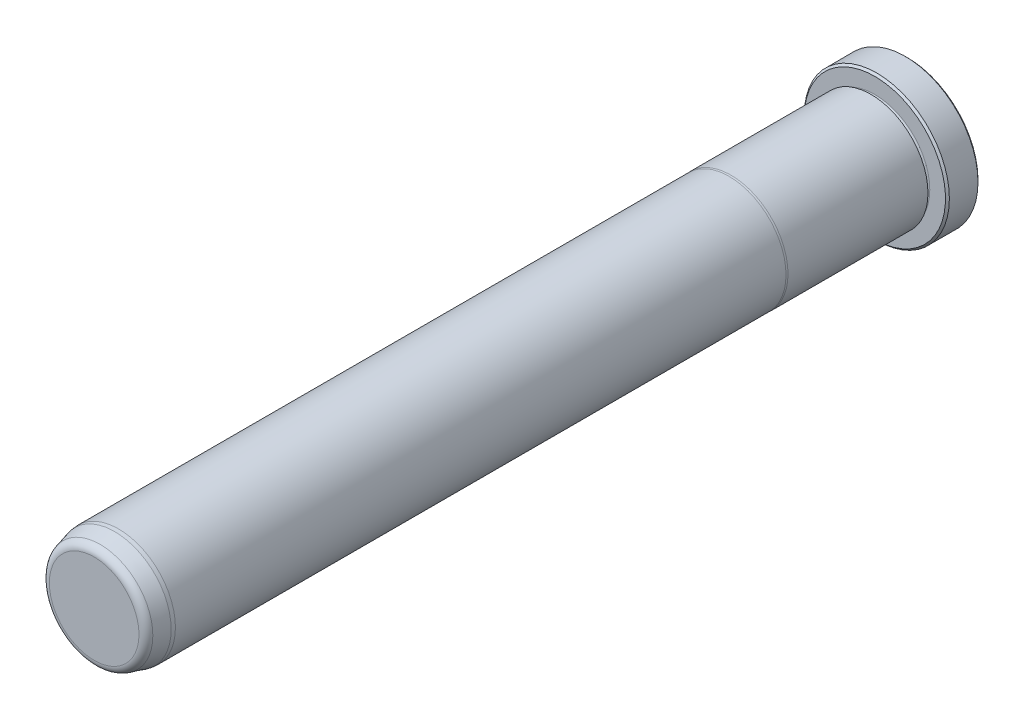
from build123d import *

# Parameters (mm, degrees)
FILLET6_R     = 1.5875
CHAMFER1_SIZE = 0.381


with BuildPart() as part:
    # Sketch1 → Revolve1 (revolve)
    with BuildSketch(Plane(origin=(0, 0, 0), x_dir=(0, 0, -1), z_dir=(1, 0, 0)), mode=Mode.PRIVATE) as revolve1_sk:
        with BuildLine():
            Line((0, 0), (0, 14.1605))
            Line((0, 14.1605), (-6.35, 14.1605))
            Line((-6.35, 14.1605), (-6.35, 10.7188))
            ThreePointArc((-6.35, 10.7188), (-6.731, 10.3378), (-7.112, 10.7188))
            Line((-7.112, 10.7188), (-7.112, 11.1252))
            Line((-7.112, 11.1252), (-34.434763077, 11.1252))
            Line((-34.434763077, 11.1252), (-34.798, 11.0998))
            Line((-34.798, 11.0998), (-153.9875, 11.0998))
            Line((-153.9875, 11.0998), (-154.7495, 11.033133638))
            Line((-154.7495, 11.033133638), (-158.75, 9.961202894))
            Line((-158.75, 9.961202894), (-158.75, 0))
            Line((-158.75, 0), (0, 0))
        make_face()
    revolve(revolve1_sk.sketch.rotate(Axis((0, 0, 0), (0, 0, -1)), 90), axis=Axis((0, 0, 0), (0, 0, -1)))

    # Fillet6
    fillet6_edges = [part.edges().sort_by_distance(p)[0] for p in [
        (-9.961202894, 0, 158.75),
    ]]
    fillet(fillet6_edges, radius=FILLET6_R)

    # Chamfer1
    chamfer1_edges = [part.edges().sort_by_distance(p)[0] for p in [
        (-14.1605, 0, 6.35),
        (-14.1605, 0, 0),
    ]]
    chamfer(chamfer1_edges, length=CHAMFER1_SIZE)


solid = part.part
